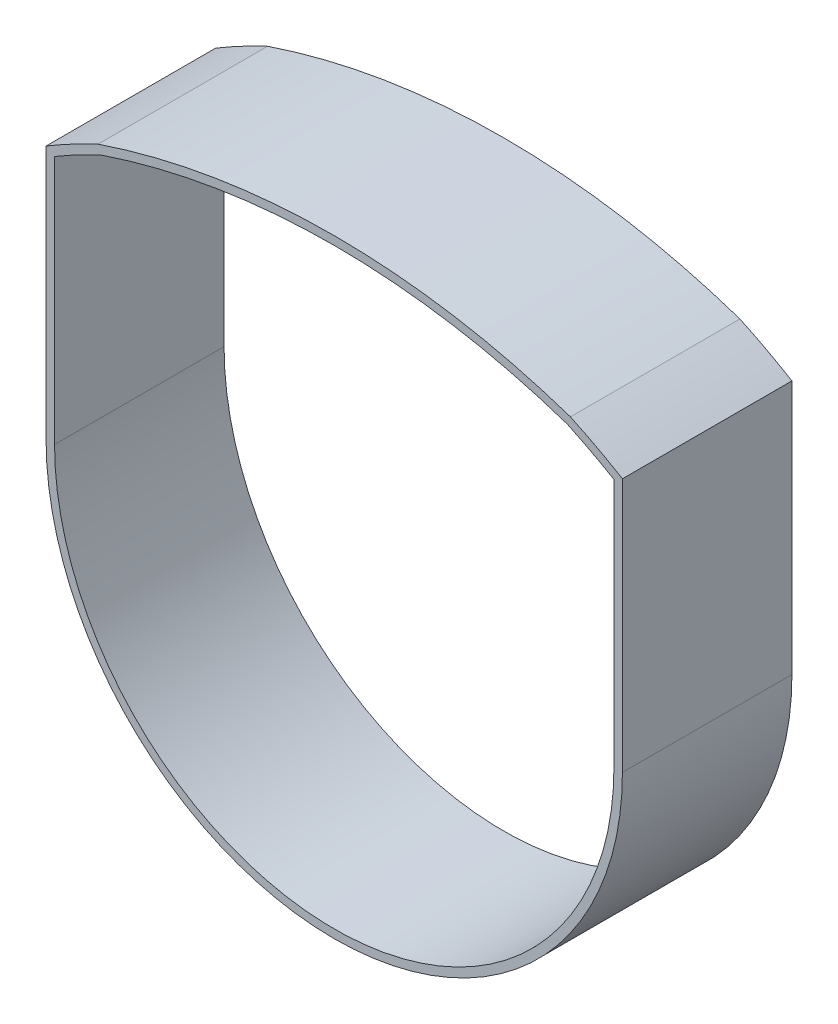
ISO-10303-21;
HEADER;
FILE_DESCRIPTION(('STEP AP214'),'2;1');
FILE_NAME('part.step','',(''),(''),'','','');
FILE_SCHEMA(('AUTOMOTIVE_DESIGN { 1 0 10303 214 1 1 1 1 }'));
ENDSEC;
DATA;
#1=APPLICATION_CONTEXT('core data for automotive mechanical design processes');
#2=APPLICATION_PROTOCOL_DEFINITION('international standard','automotive_design',2000,#1);
#3=PRODUCT_CONTEXT('',#1,'mechanical');
#4=PRODUCT('Part','Part','',(#3));
#5=PRODUCT_RELATED_PRODUCT_CATEGORY('part','',(#4));
#6=PRODUCT_DEFINITION_FORMATION('','',#4);
#7=PRODUCT_DEFINITION_CONTEXT('part definition',#1,'design');
#8=PRODUCT_DEFINITION('design','',#6,#7);
#9=PRODUCT_DEFINITION_SHAPE('','',#8);
#10=(LENGTH_UNIT() NAMED_UNIT(*) SI_UNIT(.MILLI.,.METRE.));
#11=(NAMED_UNIT(*) PLANE_ANGLE_UNIT() SI_UNIT($,.RADIAN.));
#12=(NAMED_UNIT(*) SI_UNIT($,.STERADIAN.) SOLID_ANGLE_UNIT());
#13=UNCERTAINTY_MEASURE_WITH_UNIT(LENGTH_MEASURE(1.E-05),#10,'distance_accuracy_value','');
#14=(GEOMETRIC_REPRESENTATION_CONTEXT(3) GLOBAL_UNCERTAINTY_ASSIGNED_CONTEXT((#13)) GLOBAL_UNIT_ASSIGNED_CONTEXT((#10,
#11,#12)) REPRESENTATION_CONTEXT('',''));
#15=CARTESIAN_POINT('',(0.,0.,0.));
#16=DIRECTION('',(0.,0.,1.));
#17=DIRECTION('',(1.,0.,0.));
#18=AXIS2_PLACEMENT_3D('',#15,#16,#17);
#19=CARTESIAN_POINT('',(0.,-58.5,10.));
#20=DIRECTION('',(0.,0.,1.));
#21=DIRECTION('',(1.,0.,0.));
#22=AXIS2_PLACEMENT_3D('',#19,#20,#21);
#23=PLANE('',#22);
#24=CARTESIAN_POINT('',(0.,-58.5,10.));
#25=DIRECTION('',(0.,0.,1.));
#26=DIRECTION('',(1.,0.,0.));
#27=AXIS2_PLACEMENT_3D('',#24,#25,#26);
#28=CIRCLE('',#27,34.);
#29=CARTESIAN_POINT('',(-34.,-58.5,10.));
#30=VERTEX_POINT('',#29);
#31=CARTESIAN_POINT('',(34.,-58.5,10.));
#32=VERTEX_POINT('',#31);
#33=EDGE_CURVE('E131',#30,#32,#28,.T.);
#34=ORIENTED_EDGE('',*,*,#33,.T.);
#35=DIRECTION('',(0.,1.,0.));
#36=VECTOR('',#35,1.);
#37=CARTESIAN_POINT('',(34.,-58.5,10.));
#38=LINE('',#37,#36);
#39=CARTESIAN_POINT('',(34.,-28.5,10.));
#40=VERTEX_POINT('',#39);
#41=EDGE_CURVE('E194',#32,#40,#38,.T.);
#42=ORIENTED_EDGE('',*,*,#41,.T.);
#43=CARTESIAN_POINT('',(0.,-85.0685424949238,10.));
#44=DIRECTION('',(0.,0.,1.));
#45=DIRECTION('',(1.,0.,0.));
#46=AXIS2_PLACEMENT_3D('',#43,#44,#45);
#47=CIRCLE('',#46,66.);
#48=CARTESIAN_POINT('',(27.8640411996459,-25.2388240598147,10.));
#49=VERTEX_POINT('',#48);
#50=EDGE_CURVE('E196',#40,#49,#47,.T.);
#51=ORIENTED_EDGE('',*,*,#50,.T.);
#52=CARTESIAN_POINT('',(0.,-107.65602619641,10.));
#53=DIRECTION('',(0.,0.,1.));
#54=DIRECTION('',(1.,0.,0.));
#55=AXIS2_PLACEMENT_3D('',#52,#53,#54);
#56=CIRCLE('',#55,87.);
#57=CARTESIAN_POINT('',(-27.8640411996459,-25.2388240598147,10.));
#58=VERTEX_POINT('',#57);
#59=EDGE_CURVE('E198',#49,#58,#56,.T.);
#60=ORIENTED_EDGE('',*,*,#59,.T.);
#61=CARTESIAN_POINT('',(0.,-85.0685424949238,10.));
#62=DIRECTION('',(0.,0.,1.));
#63=DIRECTION('',(1.,0.,0.));
#64=AXIS2_PLACEMENT_3D('',#61,#62,#63);
#65=CIRCLE('',#64,66.);
#66=CARTESIAN_POINT('',(-34.,-28.5,10.));
#67=VERTEX_POINT('',#66);
#68=EDGE_CURVE('E200',#58,#67,#65,.T.);
#69=ORIENTED_EDGE('',*,*,#68,.T.);
#70=DIRECTION('',(0.,-1.,0.));
#71=VECTOR('',#70,1.);
#72=CARTESIAN_POINT('',(-34.,-28.5,10.));
#73=LINE('',#72,#71);
#74=EDGE_CURVE('E54',#67,#30,#73,.T.);
#75=ORIENTED_EDGE('',*,*,#74,.T.);
#76=EDGE_LOOP('',(#34,#42,#51,#60,#69,#75));
#77=FACE_BOUND('',#76,.T.);
#78=CARTESIAN_POINT('',(0.,-85.0685424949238,10.));
#79=DIRECTION('',(0.,0.,1.));
#80=DIRECTION('',(1.,0.,0.));
#81=AXIS2_PLACEMENT_3D('',#78,#79,#80);
#82=CIRCLE('',#81,65.);
#83=CARTESIAN_POINT('',(-27.4916350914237,-26.1685424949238,10.));
#84=VERTEX_POINT('',#83);
#85=CARTESIAN_POINT('',(-33.,-29.0685424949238,10.));
#86=VERTEX_POINT('',#85);
#87=EDGE_CURVE('E175',#84,#86,#82,.T.);
#88=ORIENTED_EDGE('',*,*,#87,.F.);
#89=CARTESIAN_POINT('',(0.,-107.65602619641,10.));
#90=DIRECTION('',(0.,0.,1.));
#91=DIRECTION('',(1.,0.,0.));
#92=AXIS2_PLACEMENT_3D('',#89,#90,#91);
#93=CIRCLE('',#92,86.);
#94=CARTESIAN_POINT('',(27.4916350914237,-26.1685424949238,10.));
#95=VERTEX_POINT('',#94);
#96=EDGE_CURVE('E128',#95,#84,#93,.T.);
#97=ORIENTED_EDGE('',*,*,#96,.F.);
#98=CARTESIAN_POINT('',(0.,-85.0685424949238,10.));
#99=DIRECTION('',(0.,0.,1.));
#100=DIRECTION('',(1.,0.,0.));
#101=AXIS2_PLACEMENT_3D('',#98,#99,#100);
#102=CIRCLE('',#101,65.);
#103=CARTESIAN_POINT('',(33.,-29.0685424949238,10.));
#104=VERTEX_POINT('',#103);
#105=EDGE_CURVE('E183',#104,#95,#102,.T.);
#106=ORIENTED_EDGE('',*,*,#105,.F.);
#107=DIRECTION('',(0.,1.,0.));
#108=VECTOR('',#107,1.);
#109=CARTESIAN_POINT('',(33.,-58.5,10.));
#110=LINE('',#109,#108);
#111=CARTESIAN_POINT('',(33.,-58.5,10.));
#112=VERTEX_POINT('',#111);
#113=EDGE_CURVE('E181',#112,#104,#110,.T.);
#114=ORIENTED_EDGE('',*,*,#113,.F.);
#115=CARTESIAN_POINT('',(0.,-58.5,10.));
#116=DIRECTION('',(0.,0.,1.));
#117=DIRECTION('',(1.,0.,0.));
#118=AXIS2_PLACEMENT_3D('',#115,#116,#117);
#119=CIRCLE('',#118,33.);
#120=CARTESIAN_POINT('',(-33.,-58.5,10.));
#121=VERTEX_POINT('',#120);
#122=EDGE_CURVE('E179',#121,#112,#119,.T.);
#123=ORIENTED_EDGE('',*,*,#122,.F.);
#124=DIRECTION('',(0.,-1.,0.));
#125=VECTOR('',#124,1.);
#126=CARTESIAN_POINT('',(-33.,-29.0685424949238,10.));
#127=LINE('',#126,#125);
#128=EDGE_CURVE('E177',#86,#121,#127,.T.);
#129=ORIENTED_EDGE('',*,*,#128,.F.);
#130=EDGE_LOOP('',(#88,#97,#106,#114,#123,#129));
#131=FACE_BOUND('',#130,.T.);
#132=ADVANCED_FACE('F31',(#77,#131),#23,.T.);
#133=CARTESIAN_POINT('',(0.,-58.5,10.));
#134=DIRECTION('',(0.,0.,-1.));
#135=DIRECTION('',(-1.,0.,0.));
#136=AXIS2_PLACEMENT_3D('',#133,#134,#135);
#137=CYLINDRICAL_SURFACE('',#136,34.);
#138=DIRECTION('',(0.,0.,-1.));
#139=VECTOR('',#138,1.);
#140=CARTESIAN_POINT('',(-34.,-58.5,10.));
#141=LINE('',#140,#139);
#142=CARTESIAN_POINT('',(-34.,-58.5,-10.));
#143=VERTEX_POINT('',#142);
#144=EDGE_CURVE('E203',#30,#143,#141,.T.);
#145=ORIENTED_EDGE('',*,*,#144,.T.);
#146=CARTESIAN_POINT('',(0.,-58.5,-10.));
#147=DIRECTION('',(0.,0.,1.));
#148=DIRECTION('',(1.,0.,0.));
#149=AXIS2_PLACEMENT_3D('',#146,#147,#148);
#150=CIRCLE('',#149,34.);
#151=CARTESIAN_POINT('',(34.,-58.5,-10.));
#152=VERTEX_POINT('',#151);
#153=EDGE_CURVE('E156',#143,#152,#150,.T.);
#154=ORIENTED_EDGE('',*,*,#153,.T.);
#155=DIRECTION('',(0.,0.,-1.));
#156=VECTOR('',#155,1.);
#157=CARTESIAN_POINT('',(34.,-58.5,10.));
#158=LINE('',#157,#156);
#159=EDGE_CURVE('E11',#32,#152,#158,.T.);
#160=ORIENTED_EDGE('',*,*,#159,.F.);
#161=ORIENTED_EDGE('',*,*,#33,.F.);
#162=EDGE_LOOP('',(#145,#154,#160,#161));
#163=FACE_BOUND('',#162,.T.);
#164=ADVANCED_FACE('F33',(#163),#137,.T.);
#165=CARTESIAN_POINT('',(34.,-58.5,10.));
#166=DIRECTION('',(-1.,0.,0.));
#167=DIRECTION('',(0.,0.,1.));
#168=AXIS2_PLACEMENT_3D('',#165,#166,#167);
#169=PLANE('',#168);
#170=ORIENTED_EDGE('',*,*,#159,.T.);
#171=DIRECTION('',(0.,1.,0.));
#172=VECTOR('',#171,1.);
#173=CARTESIAN_POINT('',(34.,-58.5,-10.));
#174=LINE('',#173,#172);
#175=CARTESIAN_POINT('',(34.,-28.5,-10.));
#176=VERTEX_POINT('',#175);
#177=EDGE_CURVE('E159',#152,#176,#174,.T.);
#178=ORIENTED_EDGE('',*,*,#177,.T.);
#179=DIRECTION('',(0.,0.,-1.));
#180=VECTOR('',#179,1.);
#181=CARTESIAN_POINT('',(34.,-28.5,10.));
#182=LINE('',#181,#180);
#183=EDGE_CURVE('E39',#40,#176,#182,.T.);
#184=ORIENTED_EDGE('',*,*,#183,.F.);
#185=ORIENTED_EDGE('',*,*,#41,.F.);
#186=EDGE_LOOP('',(#170,#178,#184,#185));
#187=FACE_BOUND('',#186,.T.);
#188=ADVANCED_FACE('F221',(#187),#169,.F.);
#189=CARTESIAN_POINT('',(0.,-85.0685424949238,10.));
#190=DIRECTION('',(0.,0.,-1.));
#191=DIRECTION('',(-1.,0.,0.));
#192=AXIS2_PLACEMENT_3D('',#189,#190,#191);
#193=CYLINDRICAL_SURFACE('',#192,66.);
#194=ORIENTED_EDGE('',*,*,#183,.T.);
#195=CARTESIAN_POINT('',(0.,-85.0685424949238,-10.));
#196=DIRECTION('',(0.,0.,1.));
#197=DIRECTION('',(1.,0.,0.));
#198=AXIS2_PLACEMENT_3D('',#195,#196,#197);
#199=CIRCLE('',#198,66.);
#200=CARTESIAN_POINT('',(27.8640411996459,-25.2388240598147,-10.));
#201=VERTEX_POINT('',#200);
#202=EDGE_CURVE('E162',#176,#201,#199,.T.);
#203=ORIENTED_EDGE('',*,*,#202,.T.);
#204=DIRECTION('',(0.,0.,-1.));
#205=VECTOR('',#204,1.);
#206=CARTESIAN_POINT('',(27.8640411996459,-25.2388240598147,10.));
#207=LINE('',#206,#205);
#208=EDGE_CURVE('E209',#49,#201,#207,.T.);
#209=ORIENTED_EDGE('',*,*,#208,.F.);
#210=ORIENTED_EDGE('',*,*,#50,.F.);
#211=EDGE_LOOP('',(#194,#203,#209,#210));
#212=FACE_BOUND('',#211,.T.);
#213=ADVANCED_FACE('F214',(#212),#193,.T.);
#214=CARTESIAN_POINT('',(0.,-107.65602619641,10.));
#215=DIRECTION('',(0.,0.,-1.));
#216=DIRECTION('',(-1.,0.,0.));
#217=AXIS2_PLACEMENT_3D('',#214,#215,#216);
#218=CYLINDRICAL_SURFACE('',#217,87.);
#219=ORIENTED_EDGE('',*,*,#208,.T.);
#220=CARTESIAN_POINT('',(0.,-107.65602619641,-10.));
#221=DIRECTION('',(0.,0.,1.));
#222=DIRECTION('',(1.,0.,0.));
#223=AXIS2_PLACEMENT_3D('',#220,#221,#222);
#224=CIRCLE('',#223,87.);
#225=CARTESIAN_POINT('',(-27.8640411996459,-25.2388240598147,-10.));
#226=VERTEX_POINT('',#225);
#227=EDGE_CURVE('E165',#201,#226,#224,.T.);
#228=ORIENTED_EDGE('',*,*,#227,.T.);
#229=DIRECTION('',(0.,0.,-1.));
#230=VECTOR('',#229,1.);
#231=CARTESIAN_POINT('',(-27.8640411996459,-25.2388240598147,10.));
#232=LINE('',#231,#230);
#233=EDGE_CURVE('E207',#58,#226,#232,.T.);
#234=ORIENTED_EDGE('',*,*,#233,.F.);
#235=ORIENTED_EDGE('',*,*,#59,.F.);
#236=EDGE_LOOP('',(#219,#228,#234,#235));
#237=FACE_BOUND('',#236,.T.);
#238=ADVANCED_FACE('F234',(#237),#218,.T.);
#239=CARTESIAN_POINT('',(0.,-85.0685424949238,10.));
#240=DIRECTION('',(0.,0.,-1.));
#241=DIRECTION('',(-1.,0.,0.));
#242=AXIS2_PLACEMENT_3D('',#239,#240,#241);
#243=CYLINDRICAL_SURFACE('',#242,66.);
#244=ORIENTED_EDGE('',*,*,#233,.T.);
#245=CARTESIAN_POINT('',(0.,-85.0685424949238,-10.));
#246=DIRECTION('',(0.,0.,1.));
#247=DIRECTION('',(1.,0.,0.));
#248=AXIS2_PLACEMENT_3D('',#245,#246,#247);
#249=CIRCLE('',#248,66.);
#250=CARTESIAN_POINT('',(-34.,-28.5,-10.));
#251=VERTEX_POINT('',#250);
#252=EDGE_CURVE('E168',#226,#251,#249,.T.);
#253=ORIENTED_EDGE('',*,*,#252,.T.);
#254=DIRECTION('',(0.,0.,-1.));
#255=VECTOR('',#254,1.);
#256=CARTESIAN_POINT('',(-34.,-28.5,10.));
#257=LINE('',#256,#255);
#258=EDGE_CURVE('E205',#67,#251,#257,.T.);
#259=ORIENTED_EDGE('',*,*,#258,.F.);
#260=ORIENTED_EDGE('',*,*,#68,.F.);
#261=EDGE_LOOP('',(#244,#253,#259,#260));
#262=FACE_BOUND('',#261,.T.);
#263=ADVANCED_FACE('F231',(#262),#243,.T.);
#264=CARTESIAN_POINT('',(-34.,-28.5,10.));
#265=DIRECTION('',(1.,0.,0.));
#266=DIRECTION('',(0.,1.,0.));
#267=AXIS2_PLACEMENT_3D('',#264,#265,#266);
#268=PLANE('',#267);
#269=ORIENTED_EDGE('',*,*,#258,.T.);
#270=DIRECTION('',(0.,-1.,0.));
#271=VECTOR('',#270,1.);
#272=CARTESIAN_POINT('',(-34.,-28.5,-10.));
#273=LINE('',#272,#271);
#274=EDGE_CURVE('E171',#251,#143,#273,.T.);
#275=ORIENTED_EDGE('',*,*,#274,.T.);
#276=ORIENTED_EDGE('',*,*,#144,.F.);
#277=ORIENTED_EDGE('',*,*,#74,.F.);
#278=EDGE_LOOP('',(#269,#275,#276,#277));
#279=FACE_BOUND('',#278,.T.);
#280=ADVANCED_FACE('F227',(#279),#268,.F.);
#281=CARTESIAN_POINT('',(0.,-107.65602619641,10.));
#282=DIRECTION('',(0.,0.,-1.));
#283=DIRECTION('',(-1.,0.,0.));
#284=AXIS2_PLACEMENT_3D('',#281,#282,#283);
#285=CYLINDRICAL_SURFACE('',#284,86.);
#286=DIRECTION('',(0.,0.,-1.));
#287=VECTOR('',#286,1.);
#288=CARTESIAN_POINT('',(-27.4916350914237,-26.1685424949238,10.));
#289=LINE('',#288,#287);
#290=CARTESIAN_POINT('',(-27.4916350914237,-26.1685424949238,-10.));
#291=VERTEX_POINT('',#290);
#292=EDGE_CURVE('E120',#84,#291,#289,.T.);
#293=ORIENTED_EDGE('',*,*,#292,.T.);
#294=CARTESIAN_POINT('',(0.,-107.65602619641,-10.));
#295=DIRECTION('',(0.,0.,1.));
#296=DIRECTION('',(1.,0.,0.));
#297=AXIS2_PLACEMENT_3D('',#294,#295,#296);
#298=CIRCLE('',#297,86.);
#299=CARTESIAN_POINT('',(27.4916350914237,-26.1685424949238,-10.));
#300=VERTEX_POINT('',#299);
#301=EDGE_CURVE('E125',#300,#291,#298,.T.);
#302=ORIENTED_EDGE('',*,*,#301,.F.);
#303=DIRECTION('',(0.,0.,-1.));
#304=VECTOR('',#303,1.);
#305=CARTESIAN_POINT('',(27.4916350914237,-26.1685424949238,10.));
#306=LINE('',#305,#304);
#307=EDGE_CURVE('E185',#95,#300,#306,.T.);
#308=ORIENTED_EDGE('',*,*,#307,.F.);
#309=ORIENTED_EDGE('',*,*,#96,.T.);
#310=EDGE_LOOP('',(#293,#302,#308,#309));
#311=FACE_BOUND('',#310,.T.);
#312=ADVANCED_FACE('F122',(#311),#285,.F.);
#313=CARTESIAN_POINT('',(0.,-85.0685424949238,10.));
#314=DIRECTION('',(0.,0.,-1.));
#315=DIRECTION('',(-1.,0.,0.));
#316=AXIS2_PLACEMENT_3D('',#313,#314,#315);
#317=CYLINDRICAL_SURFACE('',#316,65.);
#318=DIRECTION('',(0.,0.,-1.));
#319=VECTOR('',#318,1.);
#320=CARTESIAN_POINT('',(-33.,-29.0685424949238,10.));
#321=LINE('',#320,#319);
#322=CARTESIAN_POINT('',(-33.,-29.0685424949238,-10.));
#323=VERTEX_POINT('',#322);
#324=EDGE_CURVE('E132',#86,#323,#321,.T.);
#325=ORIENTED_EDGE('',*,*,#324,.T.);
#326=CARTESIAN_POINT('',(0.,-85.0685424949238,-10.));
#327=DIRECTION('',(0.,0.,1.));
#328=DIRECTION('',(1.,0.,0.));
#329=AXIS2_PLACEMENT_3D('',#326,#327,#328);
#330=CIRCLE('',#329,65.);
#331=EDGE_CURVE('E135',#291,#323,#330,.T.);
#332=ORIENTED_EDGE('',*,*,#331,.F.);
#333=ORIENTED_EDGE('',*,*,#292,.F.);
#334=ORIENTED_EDGE('',*,*,#87,.T.);
#335=EDGE_LOOP('',(#325,#332,#333,#334));
#336=FACE_BOUND('',#335,.T.);
#337=ADVANCED_FACE('F136',(#336),#317,.F.);
#338=CARTESIAN_POINT('',(-33.,-29.0685424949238,10.));
#339=DIRECTION('',(1.,0.,0.));
#340=DIRECTION('',(0.,0.,-1.));
#341=AXIS2_PLACEMENT_3D('',#338,#339,#340);
#342=PLANE('',#341);
#343=DIRECTION('',(0.,0.,-1.));
#344=VECTOR('',#343,1.);
#345=CARTESIAN_POINT('',(-33.,-58.5,10.));
#346=LINE('',#345,#344);
#347=CARTESIAN_POINT('',(-33.,-58.5,-10.));
#348=VERTEX_POINT('',#347);
#349=EDGE_CURVE('E190',#121,#348,#346,.T.);
#350=ORIENTED_EDGE('',*,*,#349,.T.);
#351=DIRECTION('',(0.,-1.,0.));
#352=VECTOR('',#351,1.);
#353=CARTESIAN_POINT('',(-33.,-29.0685424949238,-10.));
#354=LINE('',#353,#352);
#355=EDGE_CURVE('E141',#323,#348,#354,.T.);
#356=ORIENTED_EDGE('',*,*,#355,.F.);
#357=ORIENTED_EDGE('',*,*,#324,.F.);
#358=ORIENTED_EDGE('',*,*,#128,.T.);
#359=EDGE_LOOP('',(#350,#356,#357,#358));
#360=FACE_BOUND('',#359,.T.);
#361=ADVANCED_FACE('F243',(#360),#342,.T.);
#362=CARTESIAN_POINT('',(0.,-58.5,10.));
#363=DIRECTION('',(0.,0.,-1.));
#364=DIRECTION('',(-1.,0.,0.));
#365=AXIS2_PLACEMENT_3D('',#362,#363,#364);
#366=CYLINDRICAL_SURFACE('',#365,33.);
#367=DIRECTION('',(0.,0.,-1.));
#368=VECTOR('',#367,1.);
#369=CARTESIAN_POINT('',(33.,-58.5,10.));
#370=LINE('',#369,#368);
#371=CARTESIAN_POINT('',(33.,-58.5,-10.));
#372=VERTEX_POINT('',#371);
#373=EDGE_CURVE('E188',#112,#372,#370,.T.);
#374=ORIENTED_EDGE('',*,*,#373,.T.);
#375=CARTESIAN_POINT('',(0.,-58.5,-10.));
#376=DIRECTION('',(0.,0.,1.));
#377=DIRECTION('',(1.,0.,0.));
#378=AXIS2_PLACEMENT_3D('',#375,#376,#377);
#379=CIRCLE('',#378,33.);
#380=EDGE_CURVE('E150',#348,#372,#379,.T.);
#381=ORIENTED_EDGE('',*,*,#380,.F.);
#382=ORIENTED_EDGE('',*,*,#349,.F.);
#383=ORIENTED_EDGE('',*,*,#122,.T.);
#384=EDGE_LOOP('',(#374,#381,#382,#383));
#385=FACE_BOUND('',#384,.T.);
#386=ADVANCED_FACE('F248',(#385),#366,.F.);
#387=CARTESIAN_POINT('',(33.,-58.5,10.));
#388=DIRECTION('',(-1.,0.,0.));
#389=DIRECTION('',(0.,-1.,0.));
#390=AXIS2_PLACEMENT_3D('',#387,#388,#389);
#391=PLANE('',#390);
#392=DIRECTION('',(0.,0.,-1.));
#393=VECTOR('',#392,1.);
#394=CARTESIAN_POINT('',(33.,-29.0685424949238,10.));
#395=LINE('',#394,#393);
#396=CARTESIAN_POINT('',(33.,-29.0685424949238,-10.));
#397=VERTEX_POINT('',#396);
#398=EDGE_CURVE('E46',#104,#397,#395,.T.);
#399=ORIENTED_EDGE('',*,*,#398,.T.);
#400=DIRECTION('',(0.,1.,0.));
#401=VECTOR('',#400,1.);
#402=CARTESIAN_POINT('',(33.,-58.5,-10.));
#403=LINE('',#402,#401);
#404=EDGE_CURVE('E153',#372,#397,#403,.T.);
#405=ORIENTED_EDGE('',*,*,#404,.F.);
#406=ORIENTED_EDGE('',*,*,#373,.F.);
#407=ORIENTED_EDGE('',*,*,#113,.T.);
#408=EDGE_LOOP('',(#399,#405,#406,#407));
#409=FACE_BOUND('',#408,.T.);
#410=ADVANCED_FACE('F252',(#409),#391,.T.);
#411=CARTESIAN_POINT('',(0.,-85.0685424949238,10.));
#412=DIRECTION('',(0.,0.,-1.));
#413=DIRECTION('',(-1.,0.,0.));
#414=AXIS2_PLACEMENT_3D('',#411,#412,#413);
#415=CYLINDRICAL_SURFACE('',#414,65.);
#416=ORIENTED_EDGE('',*,*,#307,.T.);
#417=CARTESIAN_POINT('',(0.,-85.0685424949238,-10.));
#418=DIRECTION('',(0.,0.,1.));
#419=DIRECTION('',(1.,0.,0.));
#420=AXIS2_PLACEMENT_3D('',#417,#418,#419);
#421=CIRCLE('',#420,65.);
#422=EDGE_CURVE('E146',#397,#300,#421,.T.);
#423=ORIENTED_EDGE('',*,*,#422,.F.);
#424=ORIENTED_EDGE('',*,*,#398,.F.);
#425=ORIENTED_EDGE('',*,*,#105,.T.);
#426=EDGE_LOOP('',(#416,#423,#424,#425));
#427=FACE_BOUND('',#426,.T.);
#428=ADVANCED_FACE('F253',(#427),#415,.F.);
#429=CARTESIAN_POINT('',(0.,-58.5,-10.));
#430=DIRECTION('',(0.,0.,1.));
#431=DIRECTION('',(1.,0.,0.));
#432=AXIS2_PLACEMENT_3D('',#429,#430,#431);
#433=PLANE('',#432);
#434=ORIENTED_EDGE('',*,*,#422,.T.);
#435=ORIENTED_EDGE('',*,*,#301,.T.);
#436=ORIENTED_EDGE('',*,*,#331,.T.);
#437=ORIENTED_EDGE('',*,*,#355,.T.);
#438=ORIENTED_EDGE('',*,*,#380,.T.);
#439=ORIENTED_EDGE('',*,*,#404,.T.);
#440=EDGE_LOOP('',(#434,#435,#436,#437,#438,#439));
#441=FACE_BOUND('',#440,.T.);
#442=ORIENTED_EDGE('',*,*,#153,.F.);
#443=ORIENTED_EDGE('',*,*,#274,.F.);
#444=ORIENTED_EDGE('',*,*,#252,.F.);
#445=ORIENTED_EDGE('',*,*,#227,.F.);
#446=ORIENTED_EDGE('',*,*,#202,.F.);
#447=ORIENTED_EDGE('',*,*,#177,.F.);
#448=EDGE_LOOP('',(#442,#443,#444,#445,#446,#447));
#449=FACE_BOUND('',#448,.T.);
#450=ADVANCED_FACE('F143',(#441,#449),#433,.F.);
#451=CLOSED_SHELL('',(#132,#164,#188,#213,#238,#263,#280,#312,#337,#361,#386,#410,#428,#450));
#452=MANIFOLD_SOLID_BREP('B2',#451);
#453=ADVANCED_BREP_SHAPE_REPRESENTATION('',(#18,#452),#14);
#454=SHAPE_DEFINITION_REPRESENTATION(#9,#453);
ENDSEC;
END-ISO-10303-21;
